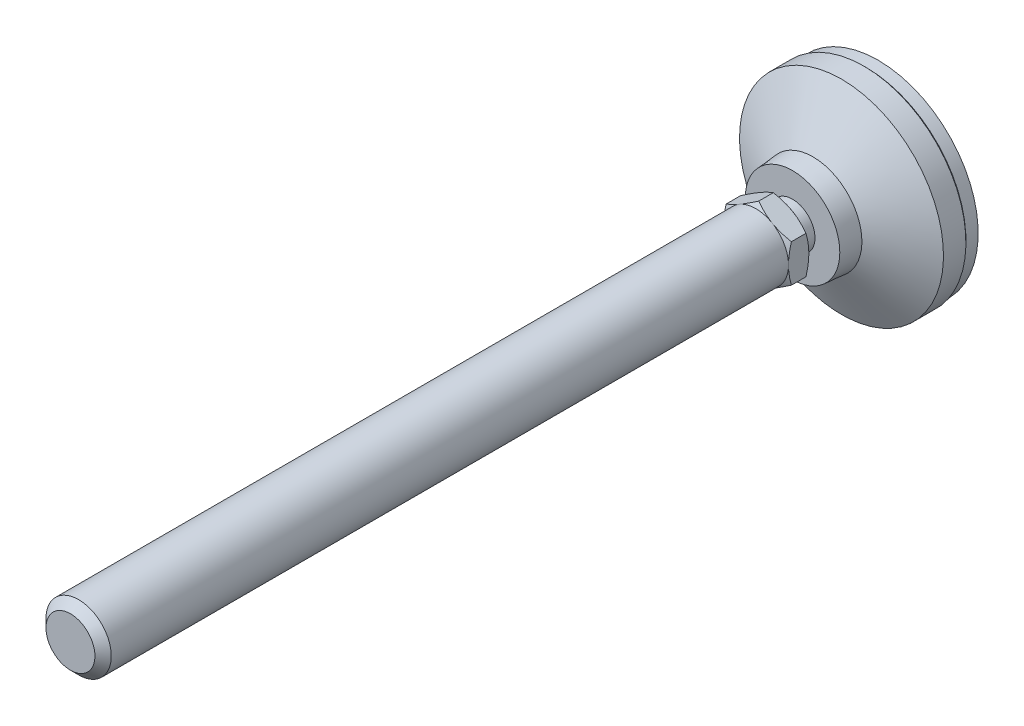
ISO-10303-21;
HEADER;
FILE_DESCRIPTION(('STEP AP214'),'2;1');
FILE_NAME('part.step','',(''),(''),'','','');
FILE_SCHEMA(('AUTOMOTIVE_DESIGN { 1 0 10303 214 1 1 1 1 }'));
ENDSEC;
DATA;
#1=APPLICATION_CONTEXT('core data for automotive mechanical design processes');
#2=APPLICATION_PROTOCOL_DEFINITION('international standard','automotive_design',2000,#1);
#3=PRODUCT_CONTEXT('',#1,'mechanical');
#4=PRODUCT('Part','Part','',(#3));
#5=PRODUCT_RELATED_PRODUCT_CATEGORY('part','',(#4));
#6=PRODUCT_DEFINITION_FORMATION('','',#4);
#7=PRODUCT_DEFINITION_CONTEXT('part definition',#1,'design');
#8=PRODUCT_DEFINITION('design','',#6,#7);
#9=PRODUCT_DEFINITION_SHAPE('','',#8);
#10=(LENGTH_UNIT() NAMED_UNIT(*) SI_UNIT(.MILLI.,.METRE.));
#11=(NAMED_UNIT(*) PLANE_ANGLE_UNIT() SI_UNIT($,.RADIAN.));
#12=(NAMED_UNIT(*) SI_UNIT($,.STERADIAN.) SOLID_ANGLE_UNIT());
#13=UNCERTAINTY_MEASURE_WITH_UNIT(LENGTH_MEASURE(1.E-05),#10,'distance_accuracy_value','');
#14=(GEOMETRIC_REPRESENTATION_CONTEXT(3) GLOBAL_UNCERTAINTY_ASSIGNED_CONTEXT((#13)) GLOBAL_UNIT_ASSIGNED_CONTEXT((#10,
#11,#12)) REPRESENTATION_CONTEXT('',''));
#15=CARTESIAN_POINT('',(0.,0.,0.));
#16=DIRECTION('',(0.,0.,1.));
#17=DIRECTION('',(1.,0.,0.));
#18=AXIS2_PLACEMENT_3D('',#15,#16,#17);
#19=CARTESIAN_POINT('',(0.,-5.50000000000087,24.9999999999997));
#20=DIRECTION('',(0.,0.,-1.));
#21=DIRECTION('',(0.,1.,0.));
#22=AXIS2_PLACEMENT_3D('',#19,#20,#21);
#23=PLANE('',#22);
#24=CARTESIAN_POINT('',(0.,0.,24.9999999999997));
#25=DIRECTION('',(0.,0.,-1.));
#26=DIRECTION('',(0.,1.,0.));
#27=AXIS2_PLACEMENT_3D('',#24,#25,#26);
#28=CIRCLE('',#27,8.00000000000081);
#29=CARTESIAN_POINT('',(-4.00000000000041,6.92820323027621,24.9999999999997));
#30=VERTEX_POINT('',#29);
#31=CARTESIAN_POINT('',(-8.00000000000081,0.,24.9999999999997));
#32=VERTEX_POINT('',#31);
#33=EDGE_CURVE('E9',#30,#32,#28,.F.);
#34=ORIENTED_EDGE('',*,*,#33,.F.);
#35=CARTESIAN_POINT('',(4.,6.92820323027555,24.9999999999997));
#36=VERTEX_POINT('',#35);
#37=EDGE_CURVE('E18',#36,#30,#28,.F.);
#38=ORIENTED_EDGE('',*,*,#37,.F.);
#39=CARTESIAN_POINT('',(8.00000000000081,0.,24.9999999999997));
#40=VERTEX_POINT('',#39);
#41=EDGE_CURVE('E125',#40,#36,#28,.F.);
#42=ORIENTED_EDGE('',*,*,#41,.F.);
#43=CARTESIAN_POINT('',(0.,0.,24.9999999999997));
#44=DIRECTION('',(0.,0.,1.));
#45=DIRECTION('',(0.,-1.,0.));
#46=AXIS2_PLACEMENT_3D('',#43,#44,#45);
#47=CIRCLE('',#46,8.00000000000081);
#48=CARTESIAN_POINT('',(4.00000000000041,-6.92820323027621,24.9999999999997));
#49=VERTEX_POINT('',#48);
#50=EDGE_CURVE('E608',#49,#40,#47,.T.);
#51=ORIENTED_EDGE('',*,*,#50,.F.);
#52=CARTESIAN_POINT('',(-4.00000000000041,-6.92820323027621,24.9999999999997));
#53=VERTEX_POINT('',#52);
#54=EDGE_CURVE('E610',#53,#49,#28,.F.);
#55=ORIENTED_EDGE('',*,*,#54,.F.);
#56=EDGE_CURVE('E23',#32,#53,#28,.F.);
#57=ORIENTED_EDGE('',*,*,#56,.F.);
#58=EDGE_LOOP('',(#34,#38,#42,#51,#55,#57));
#59=FACE_BOUND('',#58,.T.);
#60=CARTESIAN_POINT('',(0.,0.,24.9999999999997));
#61=DIRECTION('',(0.,0.,-1.));
#62=DIRECTION('',(0.,1.,0.));
#63=AXIS2_PLACEMENT_3D('',#60,#61,#62);
#64=CIRCLE('',#63,5.50000000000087);
#65=CARTESIAN_POINT('',(0.,5.50000000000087,24.9999999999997));
#66=VERTEX_POINT('',#65);
#67=EDGE_CURVE('E235',#66,#66,#64,.T.);
#68=ORIENTED_EDGE('',*,*,#67,.F.);
#69=EDGE_LOOP('',(#68));
#70=FACE_BOUND('',#69,.T.);
#71=ADVANCED_FACE('F14',(#59,#70),#23,.T.);
#72=CARTESIAN_POINT('',(0.,0.,2.));
#73=DIRECTION('',(0.,0.,-1.));
#74=DIRECTION('',(0.,1.,0.));
#75=AXIS2_PLACEMENT_3D('',#72,#73,#74);
#76=CYLINDRICAL_SURFACE('',#75,5.50000000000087);
#77=CARTESIAN_POINT('',(0.,0.,21.));
#78=DIRECTION('',(0.,0.,-1.));
#79=DIRECTION('',(0.,1.,0.));
#80=AXIS2_PLACEMENT_3D('',#77,#78,#79);
#81=CIRCLE('',#80,5.50000000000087);
#82=CARTESIAN_POINT('',(0.,5.50000000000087,21.));
#83=VERTEX_POINT('',#82);
#84=EDGE_CURVE('E238',#83,#83,#81,.T.);
#85=ORIENTED_EDGE('',*,*,#84,.F.);
#86=EDGE_LOOP('',(#85));
#87=FACE_BOUND('',#86,.T.);
#88=ORIENTED_EDGE('',*,*,#67,.T.);
#89=EDGE_LOOP('',(#88));
#90=FACE_BOUND('',#89,.T.);
#91=ADVANCED_FACE('F297',(#87,#90),#76,.T.);
#92=CARTESIAN_POINT('',(0.,-5.50000000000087,21.));
#93=DIRECTION('',(0.,0.,1.));
#94=DIRECTION('',(0.,-1.,0.));
#95=AXIS2_PLACEMENT_3D('',#92,#93,#94);
#96=PLANE('',#95);
#97=ORIENTED_EDGE('',*,*,#84,.T.);
#98=EDGE_LOOP('',(#97));
#99=FACE_BOUND('',#98,.T.);
#100=CARTESIAN_POINT('',(0.,0.,21.));
#101=DIRECTION('',(0.,0.,1.));
#102=DIRECTION('',(0.,-1.,0.));
#103=AXIS2_PLACEMENT_3D('',#100,#101,#102);
#104=CIRCLE('',#103,11.5833333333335);
#105=CARTESIAN_POINT('',(0.,-11.5833333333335,21.));
#106=VERTEX_POINT('',#105);
#107=EDGE_CURVE('E241',#106,#106,#104,.T.);
#108=ORIENTED_EDGE('',*,*,#107,.T.);
#109=EDGE_LOOP('',(#108));
#110=FACE_BOUND('',#109,.T.);
#111=ADVANCED_FACE('F199',(#99,#110),#96,.T.);
#112=CARTESIAN_POINT('',(0.,0.,2.));
#113=DIRECTION('',(0.,0.,-1.));
#114=DIRECTION('',(0.,1.,0.));
#115=AXIS2_PLACEMENT_3D('',#112,#113,#114);
#116=CYLINDRICAL_SURFACE('',#115,25.);
#117=CARTESIAN_POINT('',(0.,0.,3.5));
#118=DIRECTION('',(0.,0.,-1.));
#119=DIRECTION('',(0.,1.,0.));
#120=AXIS2_PLACEMENT_3D('',#117,#118,#119);
#121=CIRCLE('',#120,25.);
#122=CARTESIAN_POINT('',(0.,25.,3.5));
#123=VERTEX_POINT('',#122);
#124=EDGE_CURVE('E126',#123,#123,#121,.F.);
#125=ORIENTED_EDGE('',*,*,#124,.T.);
#126=EDGE_LOOP('',(#125));
#127=FACE_BOUND('',#126,.T.);
#128=CARTESIAN_POINT('',(0.,0.,8.9999999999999));
#129=DIRECTION('',(0.,0.,-1.));
#130=DIRECTION('',(0.,1.,0.));
#131=AXIS2_PLACEMENT_3D('',#128,#129,#130);
#132=CIRCLE('',#131,25.);
#133=CARTESIAN_POINT('',(0.,25.,8.9999999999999));
#134=VERTEX_POINT('',#133);
#135=EDGE_CURVE('E244',#134,#134,#132,.T.);
#136=ORIENTED_EDGE('',*,*,#135,.T.);
#137=EDGE_LOOP('',(#136));
#138=FACE_BOUND('',#137,.T.);
#139=ADVANCED_FACE('F275',(#127,#138),#116,.T.);
#140=CARTESIAN_POINT('',(0.,0.,16.));
#141=DIRECTION('',(0.,0.,-1.));
#142=DIRECTION('',(0.,1.,0.));
#143=AXIS2_PLACEMENT_3D('',#140,#141,#142);
#144=CONICAL_SURFACE('',#143,12.0000000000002,1.07685495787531);
#145=ORIENTED_EDGE('',*,*,#135,.F.);
#146=EDGE_LOOP('',(#145));
#147=FACE_BOUND('',#146,.T.);
#148=CARTESIAN_POINT('',(0.,0.,16.));
#149=DIRECTION('',(0.,0.,-1.));
#150=DIRECTION('',(0.,1.,0.));
#151=AXIS2_PLACEMENT_3D('',#148,#149,#150);
#152=CIRCLE('',#151,12.0000000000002);
#153=CARTESIAN_POINT('',(0.,12.0000000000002,16.));
#154=VERTEX_POINT('',#153);
#155=EDGE_CURVE('E260',#154,#154,#152,.T.);
#156=ORIENTED_EDGE('',*,*,#155,.T.);
#157=EDGE_LOOP('',(#156));
#158=FACE_BOUND('',#157,.T.);
#159=ADVANCED_FACE('F332',(#147,#158),#144,.T.);
#160=CARTESIAN_POINT('',(0.,0.,22.));
#161=DIRECTION('',(0.,0.,-1.));
#162=DIRECTION('',(0.,1.,0.));
#163=AXIS2_PLACEMENT_3D('',#160,#161,#162);
#164=CONICAL_SURFACE('',#163,11.5000000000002,0.0831412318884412);
#165=ORIENTED_EDGE('',*,*,#155,.F.);
#166=EDGE_LOOP('',(#165));
#167=FACE_BOUND('',#166,.T.);
#168=ORIENTED_EDGE('',*,*,#107,.F.);
#169=EDGE_LOOP('',(#168));
#170=FACE_BOUND('',#169,.T.);
#171=ADVANCED_FACE('F281',(#167,#170),#164,.T.);
#172=CARTESIAN_POINT('',(0.,0.,3.));
#173=DIRECTION('',(0.,0.,1.));
#174=DIRECTION('',(0.,-1.,0.));
#175=AXIS2_PLACEMENT_3D('',#172,#173,#174);
#176=CONICAL_SURFACE('',#175,24.5,0.785398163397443);
#177=ORIENTED_EDGE('',*,*,#124,.F.);
#178=EDGE_LOOP('',(#177));
#179=FACE_BOUND('',#178,.T.);
#180=CARTESIAN_POINT('',(0.,0.,3.));
#181=DIRECTION('',(0.,0.,-1.));
#182=DIRECTION('',(0.,1.,0.));
#183=AXIS2_PLACEMENT_3D('',#180,#181,#182);
#184=CIRCLE('',#183,24.5);
#185=CARTESIAN_POINT('',(0.,24.5,3.));
#186=VERTEX_POINT('',#185);
#187=EDGE_CURVE('E270',#186,#186,#184,.T.);
#188=ORIENTED_EDGE('',*,*,#187,.F.);
#189=EDGE_LOOP('',(#188));
#190=FACE_BOUND('',#189,.T.);
#191=ADVANCED_FACE('F16',(#179,#190),#176,.T.);
#192=CARTESIAN_POINT('',(0.,0.,0.));
#193=DIRECTION('',(0.,0.,1.));
#194=DIRECTION('',(0.,-1.,0.));
#195=AXIS2_PLACEMENT_3D('',#192,#193,#194);
#196=CYLINDRICAL_SURFACE('',#195,24.5);
#197=CARTESIAN_POINT('',(0.,0.,0.));
#198=DIRECTION('',(0.,0.,-1.));
#199=DIRECTION('',(0.,1.,0.));
#200=AXIS2_PLACEMENT_3D('',#197,#198,#199);
#201=CIRCLE('',#200,24.5);
#202=CARTESIAN_POINT('',(0.,24.5,0.));
#203=VERTEX_POINT('',#202);
#204=EDGE_CURVE('E226',#203,#203,#201,.T.);
#205=ORIENTED_EDGE('',*,*,#204,.F.);
#206=EDGE_LOOP('',(#205));
#207=FACE_BOUND('',#206,.T.);
#208=ORIENTED_EDGE('',*,*,#187,.T.);
#209=EDGE_LOOP('',(#208));
#210=FACE_BOUND('',#209,.T.);
#211=ADVANCED_FACE('F280',(#207,#210),#196,.T.);
#212=CARTESIAN_POINT('',(0.,0.,0.));
#213=DIRECTION('',(0.,0.,-1.));
#214=DIRECTION('',(0.,1.,0.));
#215=AXIS2_PLACEMENT_3D('',#212,#213,#214);
#216=PLANE('',#215);
#217=ORIENTED_EDGE('',*,*,#204,.T.);
#218=EDGE_LOOP('',(#217));
#219=FACE_BOUND('',#218,.T.);
#220=ADVANCED_FACE('F285',(#219),#216,.T.);
#221=CARTESIAN_POINT('',(0.,0.,24.9999999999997));
#222=DIRECTION('',(0.,0.,1.));
#223=DIRECTION('',(0.,-1.,0.));
#224=AXIS2_PLACEMENT_3D('',#221,#222,#223);
#225=CONICAL_SURFACE('',#224,8.00000000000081,1.0471975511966);
#226=CARTESIAN_POINT('',(-8.0002,4.61868668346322,25.7145978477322));
#227=CARTESIAN_POINT('',(-7.8243512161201,4.72021302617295,25.6559907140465));
#228=CARTESIAN_POINT('',(-7.64784680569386,4.8221178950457,25.6000434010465));
#229=CARTESIAN_POINT('',(-7.29340453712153,5.02675523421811,25.4942010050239));
#230=CARTESIAN_POINT('',(-7.11546609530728,5.12948804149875,25.4443085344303));
#231=CARTESIAN_POINT('',(-6.57880176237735,5.43933133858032,25.3046927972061));
#232=CARTESIAN_POINT('',(-6.21795741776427,5.64766491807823,25.2252811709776));
#233=CARTESIAN_POINT('',(-5.67796082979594,5.95943209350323,25.1321616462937));
#234=CARTESIAN_POINT('',(-5.50042181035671,6.06193429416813,25.1056345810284));
#235=CARTESIAN_POINT('',(-5.1445408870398,6.2674022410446,25.0611531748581));
#236=CARTESIAN_POINT('',(-4.96619905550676,6.37036794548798,25.0431980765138));
#237=CARTESIAN_POINT('',(-4.6092083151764,6.57647664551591,25.0163156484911));
#238=CARTESIAN_POINT('',(-4.43055998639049,6.67961930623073,25.0073780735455));
#239=CARTESIAN_POINT('',(-4.07309829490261,6.88599991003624,24.9987223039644));
#240=CARTESIAN_POINT('',(-3.89428493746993,6.9892378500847,24.9990038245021));
#241=CARTESIAN_POINT('',(-3.55998663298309,7.18224506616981,25.0081450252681));
#242=CARTESIAN_POINT('',(-3.40447809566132,7.27202796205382,25.0158896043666));
#243=CARTESIAN_POINT('',(-3.09382523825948,7.4513834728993,25.0382011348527));
#244=CARTESIAN_POINT('',(-2.93868094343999,7.54095607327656,25.0527685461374));
#245=CARTESIAN_POINT('',(-2.47384868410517,7.80932710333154,25.1063606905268));
#246=CARTESIAN_POINT('',(-2.16498351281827,7.98765049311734,25.1552686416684));
#247=CARTESIAN_POINT('',(-1.54397677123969,8.3461889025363,25.2775394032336));
#248=CARTESIAN_POINT('',(-1.23191445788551,8.52635816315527,25.3514205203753));
#249=CARTESIAN_POINT('',(-0.61244351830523,8.8840098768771,25.5191001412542));
#250=CARTESIAN_POINT('',(-0.305026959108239,9.06149691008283,25.6128592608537));
#251=CARTESIAN_POINT('',(0.000200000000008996,9.23771977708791,25.7145978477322));
#252=B_SPLINE_CURVE_WITH_KNOTS('',3,(#226,#227,#228,#229,#230,#231,#232,#233,#234,#235,#236,
#237,#238,#239,#240,#241,#242,#243,#244,#245,#246,#247,#248,#249,#250,#251),.UNSPECIFIED.,.F.,
.F.,(4,2,2,2,2,2,2,2,2,2,2,2,4),(0.,0.633973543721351,1.26821965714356,2.53934712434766,
3.15934343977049,3.77928496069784,4.39852133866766,5.01773858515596,5.55680239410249,
6.09590254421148,7.17487077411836,8.27776850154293,9.37850115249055),.UNSPECIFIED.);
#253=CARTESIAN_POINT('',(0.,9.23760430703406,25.7145311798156));
#254=VERTEX_POINT('',#253);
#255=EDGE_CURVE('E115',#30,#254,#252,.T.);
#256=ORIENTED_EDGE('',*,*,#255,.T.);
#257=CARTESIAN_POINT('',(-0.000199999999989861,9.2377197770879,25.7145978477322));
#258=CARTESIAN_POINT('',(0.175648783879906,9.13619343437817,25.6559907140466));
#259=CARTESIAN_POINT('',(0.352153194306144,9.03428856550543,25.6000434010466));
#260=CARTESIAN_POINT('',(0.706595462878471,8.82965122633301,25.4942010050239));
#261=CARTESIAN_POINT('',(0.884533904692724,8.72691841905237,25.4443085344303));
#262=CARTESIAN_POINT('',(1.42119823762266,8.4170751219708,25.3046927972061));
#263=CARTESIAN_POINT('',(1.78204258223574,8.20874154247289,25.2252811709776));
#264=CARTESIAN_POINT('',(2.32203917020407,7.89697436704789,25.1321616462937));
#265=CARTESIAN_POINT('',(2.4995781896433,7.79447216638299,25.1056345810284));
#266=CARTESIAN_POINT('',(2.85545911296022,7.58900421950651,25.0611531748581));
#267=CARTESIAN_POINT('',(3.03380094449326,7.48603851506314,25.0431980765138));
#268=CARTESIAN_POINT('',(3.39079168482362,7.27992981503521,25.0163156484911));
#269=CARTESIAN_POINT('',(3.56944001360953,7.17678715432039,25.0073780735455));
#270=CARTESIAN_POINT('',(3.92690170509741,6.97040655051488,24.9987223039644));
#271=CARTESIAN_POINT('',(4.1057150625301,6.86716861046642,24.9990038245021));
#272=CARTESIAN_POINT('',(4.44001336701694,6.67416139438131,25.0081450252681));
#273=CARTESIAN_POINT('',(4.5955219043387,6.5843784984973,25.0158896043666));
#274=CARTESIAN_POINT('',(4.90617476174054,6.40502298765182,25.0382011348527));
#275=CARTESIAN_POINT('',(5.06131905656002,6.31545038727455,25.0527685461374));
#276=CARTESIAN_POINT('',(5.52615131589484,6.04707935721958,25.1063606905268));
#277=CARTESIAN_POINT('',(5.83501648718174,5.86875596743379,25.1552686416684));
#278=CARTESIAN_POINT('',(6.45602322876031,5.51021755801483,25.2775394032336));
#279=CARTESIAN_POINT('',(6.76808554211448,5.33004829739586,25.3514205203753));
#280=CARTESIAN_POINT('',(7.38755648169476,4.97239658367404,25.5191001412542));
#281=CARTESIAN_POINT('',(7.69497304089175,4.79490955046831,25.6128592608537));
#282=CARTESIAN_POINT('',(8.0002,4.61868668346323,25.7145978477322));
#283=B_SPLINE_CURVE_WITH_KNOTS('',3,(#257,#258,#259,#260,#261,#262,#263,#264,#265,#266,#267,
#268,#269,#270,#271,#272,#273,#274,#275,#276,#277,#278,#279,#280,#281,#282),.UNSPECIFIED.,.F.,
.F.,(4,2,2,2,2,2,2,2,2,2,2,2,4),(0.,0.633973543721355,1.26821965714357,2.53934712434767,
3.1593434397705,3.77928496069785,4.39852133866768,5.01773858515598,5.55680239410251,
6.09590254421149,7.17487077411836,8.27776850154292,9.37850115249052),.UNSPECIFIED.);
#284=EDGE_CURVE('E121',#254,#36,#283,.T.);
#285=ORIENTED_EDGE('',*,*,#284,.T.);
#286=ORIENTED_EDGE('',*,*,#37,.T.);
#287=EDGE_LOOP('',(#256,#285,#286));
#288=FACE_BOUND('',#287,.T.);
#289=ADVANCED_FACE('F119',(#288),#225,.T.);
#290=CARTESIAN_POINT('',(8.,12.3262731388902,28.865241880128));
#291=CARTESIAN_POINT('',(8.,11.9775305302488,28.6963953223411));
#292=CARTESIAN_POINT('',(8.,11.6279786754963,28.5291911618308));
#293=CARTESIAN_POINT('',(8.,10.9268257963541,28.1989930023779));
#294=CARTESIAN_POINT('',(8.,10.5752244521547,28.0359996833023));
#295=CARTESIAN_POINT('',(8.,9.86769141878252,27.7143112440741));
#296=CARTESIAN_POINT('',(8.,9.511746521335,27.5556450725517));
#297=CARTESIAN_POINT('',(8.,8.79699745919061,27.2449141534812));
#298=CARTESIAN_POINT('',(8.,8.43819343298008,27.092849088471));
#299=CARTESIAN_POINT('',(8.,7.70588014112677,26.7924406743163));
#300=CARTESIAN_POINT('',(8.,7.33226167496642,26.6443620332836));
#301=CARTESIAN_POINT('',(8.,6.58062493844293,26.3596078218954));
#302=CARTESIAN_POINT('',(8.,6.20260617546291,26.2229335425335));
#303=CARTESIAN_POINT('',(8.,5.44229684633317,25.9646356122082));
#304=CARTESIAN_POINT('',(8.,5.06001698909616,25.8429807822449));
#305=CARTESIAN_POINT('',(8.,4.28998858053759,25.6186766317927));
#306=CARTESIAN_POINT('',(8.,3.90224181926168,25.5160212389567));
#307=CARTESIAN_POINT('',(8.,3.12313529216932,25.3352448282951));
#308=CARTESIAN_POINT('',(8.,2.73180659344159,25.2569935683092));
#309=CARTESIAN_POINT('',(8.,2.14131517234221,25.1613463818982));
#310=CARTESIAN_POINT('',(8.,1.94388648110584,25.1330842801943));
#311=CARTESIAN_POINT('',(8.,1.54807537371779,25.0843594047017));
#312=CARTESIAN_POINT('',(8.,1.34969305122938,25.0638958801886));
#313=CARTESIAN_POINT('',(8.,0.954796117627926,25.0314283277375));
#314=CARTESIAN_POINT('',(8.,0.758290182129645,25.0193191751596));
#315=CARTESIAN_POINT('',(8.,0.364942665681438,25.0034158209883));
#316=CARTESIAN_POINT('',(8.,0.168101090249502,24.9996214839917));
#317=CARTESIAN_POINT('',(8.,-0.225566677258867,25.0004380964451));
#318=CARTESIAN_POINT('',(8.,-0.422392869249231,25.0050490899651));
#319=CARTESIAN_POINT('',(8.,-0.815678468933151,25.0225650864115));
#320=CARTESIAN_POINT('',(8.,-1.01213785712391,25.0354705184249));
#321=CARTESIAN_POINT('',(8.,-1.48676568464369,25.0763980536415));
#322=CARTESIAN_POINT('',(8.,-1.7645900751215,25.1084929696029));
#323=CARTESIAN_POINT('',(8.,-2.31811044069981,25.1875002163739));
#324=CARTESIAN_POINT('',(8.,-2.59380611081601,25.2344146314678));
#325=CARTESIAN_POINT('',(8.,-3.41742295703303,25.3948936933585));
#326=CARTESIAN_POINT('',(8.,-3.96155187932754,25.528162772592));
#327=CARTESIAN_POINT('',(8.,-4.7750432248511,25.7584190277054));
#328=CARTESIAN_POINT('',(8.,-5.04864650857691,25.8412779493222));
#329=CARTESIAN_POINT('',(8.,-5.59319443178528,26.0153922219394));
#330=CARTESIAN_POINT('',(8.,-5.86413905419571,26.1066476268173));
#331=CARTESIAN_POINT('',(8.,-6.40345876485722,26.2961082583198));
#332=CARTESIAN_POINT('',(8.,-6.67183471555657,26.394311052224));
#333=CARTESIAN_POINT('',(8.,-7.20637750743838,26.5965320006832));
#334=CARTESIAN_POINT('',(8.,-7.4725443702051,26.7005500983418));
#335=CARTESIAN_POINT('',(8.,-8.08232914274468,26.9453078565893));
#336=CARTESIAN_POINT('',(8.,-8.42527540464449,27.0877173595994));
#337=CARTESIAN_POINT('',(8.,-9.10839625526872,27.379052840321));
#338=CARTESIAN_POINT('',(8.,-9.44857070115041,27.5279791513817));
#339=CARTESIAN_POINT('',(8.,-10.1266404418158,27.8310930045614));
#340=CARTESIAN_POINT('',(8.,-10.4645352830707,27.9852815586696));
#341=CARTESIAN_POINT('',(8.,-11.1383455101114,28.2979008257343));
#342=CARTESIAN_POINT('',(8.,-11.4742609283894,28.4563314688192));
#343=CARTESIAN_POINT('',(8.,-12.1447339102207,28.7768152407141));
#344=CARTESIAN_POINT('',(8.,-12.4792899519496,28.938871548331));
#345=CARTESIAN_POINT('',(8.,-13.146990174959,29.2658694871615));
#346=CARTESIAN_POINT('',(8.,-13.4801343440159,29.4308111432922));
#347=CARTESIAN_POINT('',(8.,-14.477789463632,29.9292294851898));
#348=CARTESIAN_POINT('',(8.,-15.1405093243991,30.266292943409));
#349=CARTESIAN_POINT('',(8.,-16.1057093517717,30.7634786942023));
#350=CARTESIAN_POINT('',(8.,-16.4095795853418,30.9209192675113));
#351=CARTESIAN_POINT('',(8.,-17.0166569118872,31.2370623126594));
#352=CARTESIAN_POINT('',(8.,-17.319864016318,31.3957647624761));
#353=CARTESIAN_POINT('',(8.,-18.2286454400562,31.8735243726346));
#354=CARTESIAN_POINT('',(8.,-18.8333572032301,32.194222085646));
#355=CARTESIAN_POINT('',(8.,-20.0396119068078,32.8382356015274));
#356=CARTESIAN_POINT('',(8.,-20.6411589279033,33.1615437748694));
#357=CARTESIAN_POINT('',(8.,-21.8427836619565,33.8108079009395));
#358=CARTESIAN_POINT('',(8.,-22.4428614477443,34.1367637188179));
#359=CARTESIAN_POINT('',(8.,-23.0423928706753,34.4637150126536));
#360=B_SPLINE_CURVE_WITH_KNOTS('',3,(#290,#291,#292,#293,#294,#295,#296,#297,#298,#299,#300,
#301,#302,#303,#304,#305,#306,#307,#308,#309,#310,#311,#312,#313,#314,#315,#316,#317,#318,#319,
#320,#321,#322,#323,#324,#325,#326,#327,#328,#329,#330,#331,#332,#333,#334,#335,#336,#337,#338,
#339,#340,#341,#342,#343,#344,#345,#346,#347,#348,#349,#350,#351,#352,#353,#354,#355,#356,#357,
#358,#359),.UNSPECIFIED.,.F.,.F.,(4,2,2,2,2,2,2,2,2,2,2,2,2,2,2,2,2,2,2,2,2,2,2,2,2,2,2,2,2,2,2,
2,2,2,4),(0.,1.16241516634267,2.32501685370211,3.49408487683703,4.66309661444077,
5.86863143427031,7.0743025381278,8.27742712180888,9.4801665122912,10.6763725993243,
11.2745666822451,11.8727031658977,12.4631687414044,13.0536247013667,13.6440837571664,
14.2345733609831,15.0731140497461,15.9117727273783,17.5900565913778,18.4476120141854,
19.3051729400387,20.1624350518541,21.0196887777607,22.1336168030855,23.2476018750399,
24.3618023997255,25.4759845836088,26.5911851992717,27.7063954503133,29.9368615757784,
30.9635649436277,31.9902504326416,34.0436979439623,36.0924670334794,38.1411324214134),.UNSPECIFIED.);
#361=CARTESIAN_POINT('',(8.,4.61880215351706,25.7145311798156));
#362=VERTEX_POINT('',#361);
#363=EDGE_CURVE('E134',#362,#40,#360,.T.);
#364=ORIENTED_EDGE('',*,*,#363,.T.);
#365=ORIENTED_EDGE('',*,*,#41,.T.);
#366=EDGE_CURVE('E171',#36,#362,#283,.T.);
#367=ORIENTED_EDGE('',*,*,#366,.T.);
#368=EDGE_LOOP('',(#364,#365,#367));
#369=FACE_BOUND('',#368,.T.);
#370=ADVANCED_FACE('F159',(#369),#225,.T.);
#371=CARTESIAN_POINT('',(8.0002,-4.61868668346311,25.7145978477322));
#372=CARTESIAN_POINT('',(7.82435121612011,-4.72021302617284,25.6559907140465));
#373=CARTESIAN_POINT('',(7.64784680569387,-4.82211789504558,25.6000434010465));
#374=CARTESIAN_POINT('',(7.29340453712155,-5.02675523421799,25.4942010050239));
#375=CARTESIAN_POINT('',(7.1154660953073,-5.12948804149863,25.4443085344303));
#376=CARTESIAN_POINT('',(6.57880176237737,-5.4393313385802,25.3046927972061));
#377=CARTESIAN_POINT('',(6.21795741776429,-5.64766491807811,25.2252811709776));
#378=CARTESIAN_POINT('',(5.67796082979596,-5.95943209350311,25.1321616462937));
#379=CARTESIAN_POINT('',(5.50042181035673,-6.06193429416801,25.1056345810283));
#380=CARTESIAN_POINT('',(5.14454088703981,-6.26740224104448,25.0611531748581));
#381=CARTESIAN_POINT('',(4.96619905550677,-6.37036794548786,25.0431980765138));
#382=CARTESIAN_POINT('',(4.60920831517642,-6.57647664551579,25.0163156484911));
#383=CARTESIAN_POINT('',(4.43055998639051,-6.67961930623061,25.0073780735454));
#384=CARTESIAN_POINT('',(4.07309829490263,-6.88599991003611,24.9987223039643));
#385=CARTESIAN_POINT('',(3.89428493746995,-6.98923785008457,24.999003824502));
#386=CARTESIAN_POINT('',(3.55998663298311,-7.18224506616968,25.008145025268));
#387=CARTESIAN_POINT('',(3.40447809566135,-7.27202796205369,25.0158896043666));
#388=CARTESIAN_POINT('',(3.09382523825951,-7.45138347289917,25.0382011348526));
#389=CARTESIAN_POINT('',(2.93868094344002,-7.54095607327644,25.0527685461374));
#390=CARTESIAN_POINT('',(2.4738486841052,-7.80932710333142,25.1063606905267));
#391=CARTESIAN_POINT('',(2.16498351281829,-7.98765049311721,25.1552686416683));
#392=CARTESIAN_POINT('',(1.54397677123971,-8.34618890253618,25.2775394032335));
#393=CARTESIAN_POINT('',(1.23191445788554,-8.52635816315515,25.3514205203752));
#394=CARTESIAN_POINT('',(0.61244351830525,-8.88400987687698,25.5191001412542));
#395=CARTESIAN_POINT('',(0.305026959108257,-9.06149691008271,25.6128592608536));
#396=CARTESIAN_POINT('',(-0.000199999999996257,-9.23771977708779,25.7145978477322));
#397=B_SPLINE_CURVE_WITH_KNOTS('',3,(#371,#372,#373,#374,#375,#376,#377,#378,#379,#380,#381,
#382,#383,#384,#385,#386,#387,#388,#389,#390,#391,#392,#393,#394,#395,#396),.UNSPECIFIED.,.F.,
.F.,(4,2,2,2,2,2,2,2,2,2,2,2,4),(0.,0.633973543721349,1.26821965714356,2.53934712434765,
3.15934343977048,3.77928496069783,4.39852133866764,5.01773858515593,5.55680239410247,
6.09590254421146,7.17487077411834,8.27776850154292,9.37850115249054),.UNSPECIFIED.);
#398=CARTESIAN_POINT('',(8.,-4.61880215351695,25.7145311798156));
#399=VERTEX_POINT('',#398);
#400=EDGE_CURVE('E149',#399,#49,#397,.T.);
#401=ORIENTED_EDGE('',*,*,#400,.T.);
#402=ORIENTED_EDGE('',*,*,#50,.T.);
#403=EDGE_CURVE('E114',#40,#399,#360,.T.);
#404=ORIENTED_EDGE('',*,*,#403,.T.);
#405=EDGE_LOOP('',(#401,#402,#404));
#406=FACE_BOUND('',#405,.T.);
#407=ADVANCED_FACE('F163',(#406),#225,.T.);
#408=CARTESIAN_POINT('',(0.00020000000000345,-9.23771977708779,25.7145978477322));
#409=CARTESIAN_POINT('',(-0.175648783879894,-9.13619343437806,25.6559907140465));
#410=CARTESIAN_POINT('',(-0.352153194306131,-9.03428856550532,25.6000434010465));
#411=CARTESIAN_POINT('',(-0.706595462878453,-8.8296512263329,25.4942010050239));
#412=CARTESIAN_POINT('',(-0.884533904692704,-8.72691841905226,25.4443085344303));
#413=CARTESIAN_POINT('',(-1.42119823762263,-8.4170751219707,25.3046927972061));
#414=CARTESIAN_POINT('',(-1.78204258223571,-8.20874154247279,25.2252811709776));
#415=CARTESIAN_POINT('',(-2.32203917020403,-7.8969743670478,25.1321616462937));
#416=CARTESIAN_POINT('',(-2.49957818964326,-7.79447216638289,25.1056345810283));
#417=CARTESIAN_POINT('',(-2.85545911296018,-7.58900421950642,25.0611531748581));
#418=CARTESIAN_POINT('',(-3.03380094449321,-7.48603851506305,25.0431980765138));
#419=CARTESIAN_POINT('',(-3.39079168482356,-7.27992981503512,25.0163156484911));
#420=CARTESIAN_POINT('',(-3.56944001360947,-7.1767871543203,25.0073780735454));
#421=CARTESIAN_POINT('',(-3.92690170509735,-6.97040655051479,24.9987223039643));
#422=CARTESIAN_POINT('',(-4.10571506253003,-6.86716861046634,24.999003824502));
#423=CARTESIAN_POINT('',(-4.44001336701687,-6.67416139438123,25.008145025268));
#424=CARTESIAN_POINT('',(-4.59552190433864,-6.58437849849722,25.0158896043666));
#425=CARTESIAN_POINT('',(-4.90617476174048,-6.40502298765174,25.0382011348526));
#426=CARTESIAN_POINT('',(-5.06131905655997,-6.31545038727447,25.0527685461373));
#427=CARTESIAN_POINT('',(-5.52615131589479,-6.04707935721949,25.1063606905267));
#428=CARTESIAN_POINT('',(-5.8350164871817,-5.86875596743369,25.1552686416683));
#429=CARTESIAN_POINT('',(-6.45602322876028,-5.51021755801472,25.2775394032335));
#430=CARTESIAN_POINT('',(-6.76808554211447,-5.33004829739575,25.3514205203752));
#431=CARTESIAN_POINT('',(-7.38755648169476,-4.97239658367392,25.5191001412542));
#432=CARTESIAN_POINT('',(-7.69497304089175,-4.79490955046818,25.6128592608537));
#433=CARTESIAN_POINT('',(-8.0002,-4.6186866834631,25.7145978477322));
#434=B_SPLINE_CURVE_WITH_KNOTS('',3,(#408,#409,#410,#411,#412,#413,#414,#415,#416,#417,#418,
#419,#420,#421,#422,#423,#424,#425,#426,#427,#428,#429,#430,#431,#432,#433),.UNSPECIFIED.,.F.,
.F.,(4,2,2,2,2,2,2,2,2,2,2,2,4),(0.,0.633973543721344,1.26821965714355,2.53934712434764,
3.15934343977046,3.7792849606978,4.39852133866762,5.01773858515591,5.55680239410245,
6.09590254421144,7.17487077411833,8.27776850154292,9.37850115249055),.UNSPECIFIED.);
#435=CARTESIAN_POINT('',(0.,-9.23760430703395,25.7145311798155));
#436=VERTEX_POINT('',#435);
#437=EDGE_CURVE('E37',#436,#53,#434,.T.);
#438=ORIENTED_EDGE('',*,*,#437,.T.);
#439=ORIENTED_EDGE('',*,*,#54,.T.);
#440=EDGE_CURVE('E552',#49,#436,#397,.T.);
#441=ORIENTED_EDGE('',*,*,#440,.T.);
#442=EDGE_LOOP('',(#438,#439,#441));
#443=FACE_BOUND('',#442,.T.);
#444=ADVANCED_FACE('F165',(#443),#225,.T.);
#445=CARTESIAN_POINT('',(-8.,-4.61880215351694,25.7145311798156));
#446=VERTEX_POINT('',#445);
#447=EDGE_CURVE('E186',#53,#446,#434,.T.);
#448=ORIENTED_EDGE('',*,*,#447,.T.);
#449=CARTESIAN_POINT('',(-8.,12.3262731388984,28.8652418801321));
#450=CARTESIAN_POINT('',(-8.,11.9775305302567,28.6963953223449));
#451=CARTESIAN_POINT('',(-8.00000000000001,11.627978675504,28.5291911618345));
#452=CARTESIAN_POINT('',(-8.00000000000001,10.9268257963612,28.1989930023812));
#453=CARTESIAN_POINT('',(-8.00000000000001,10.5752244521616,28.0359996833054));
#454=CARTESIAN_POINT('',(-8.00000000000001,9.86769141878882,27.7143112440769));
#455=CARTESIAN_POINT('',(-8.00000000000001,9.51174652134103,27.5556450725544));
#456=CARTESIAN_POINT('',(-8.00000000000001,8.79699745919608,27.2449141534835));
#457=CARTESIAN_POINT('',(-8.00000000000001,8.43819343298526,27.0928490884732));
#458=CARTESIAN_POINT('',(-8.00000000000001,7.70588014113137,26.7924406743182));
#459=CARTESIAN_POINT('',(-8.00000000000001,7.33226167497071,26.6443620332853));
#460=CARTESIAN_POINT('',(-8.00000000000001,6.5806249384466,26.3596078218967));
#461=CARTESIAN_POINT('',(-8.,6.20260617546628,26.2229335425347));
#462=CARTESIAN_POINT('',(-8.,5.44229684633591,25.9646356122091));
#463=CARTESIAN_POINT('',(-8.00000000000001,5.06001698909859,25.8429807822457));
#464=CARTESIAN_POINT('',(-8.,4.28998858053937,25.6186766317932));
#465=CARTESIAN_POINT('',(-8.,3.90224181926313,25.5160212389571));
#466=CARTESIAN_POINT('',(-8.,3.12313529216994,25.3352448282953));
#467=CARTESIAN_POINT('',(-8.,2.73180659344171,25.2569935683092));
#468=CARTESIAN_POINT('',(-8.,2.14131517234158,25.1613463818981));
#469=CARTESIAN_POINT('',(-8.,1.94388648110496,25.1330842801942));
#470=CARTESIAN_POINT('',(-8.,1.54807537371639,25.0843594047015));
#471=CARTESIAN_POINT('',(-8.,1.34969305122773,25.0638958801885));
#472=CARTESIAN_POINT('',(-8.,0.954796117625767,25.0314283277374));
#473=CARTESIAN_POINT('',(-8.,0.758290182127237,25.0193191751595));
#474=CARTESIAN_POINT('',(-8.,0.36494266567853,25.0034158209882));
#475=CARTESIAN_POINT('',(-8.,0.168101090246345,24.9996214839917));
#476=CARTESIAN_POINT('',(-8.,-0.22556667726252,25.0004380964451));
#477=CARTESIAN_POINT('',(-8.,-0.422392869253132,25.0050490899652));
#478=CARTESIAN_POINT('',(-8.,-0.815678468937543,25.0225650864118));
#479=CARTESIAN_POINT('',(-8.,-1.01213785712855,25.0354705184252));
#480=CARTESIAN_POINT('',(-8.,-1.48676568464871,25.0763980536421));
#481=CARTESIAN_POINT('',(-8.,-1.76459007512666,25.1084929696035));
#482=CARTESIAN_POINT('',(-8.,-2.31811044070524,25.1875002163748));
#483=CARTESIAN_POINT('',(-8.,-2.59380611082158,25.2344146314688));
#484=CARTESIAN_POINT('',(-8.,-3.41742295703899,25.3948936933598));
#485=CARTESIAN_POINT('',(-8.,-3.96155187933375,25.5281627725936));
#486=CARTESIAN_POINT('',(-8.,-4.7750432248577,25.7584190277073));
#487=CARTESIAN_POINT('',(-8.,-5.04864650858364,25.8412779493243));
#488=CARTESIAN_POINT('',(-8.,-5.59319443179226,26.0153922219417));
#489=CARTESIAN_POINT('',(-8.,-5.86413905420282,26.1066476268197));
#490=CARTESIAN_POINT('',(-8.,-6.40345876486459,26.2961082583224));
#491=CARTESIAN_POINT('',(-8.,-6.67183471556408,26.3943110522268));
#492=CARTESIAN_POINT('',(-8.,-7.20637750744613,26.5965320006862));
#493=CARTESIAN_POINT('',(-8.,-7.47254437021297,26.7005500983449));
#494=CARTESIAN_POINT('',(-8.,-8.08232914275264,26.9453078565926));
#495=CARTESIAN_POINT('',(-8.,-8.42527540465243,27.0877173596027));
#496=CARTESIAN_POINT('',(-8.,-9.1083962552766,27.3790528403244));
#497=CARTESIAN_POINT('',(-8.,-9.44857070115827,27.5279791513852));
#498=CARTESIAN_POINT('',(-8.,-10.1266404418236,27.831093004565));
#499=CARTESIAN_POINT('',(-8.,-10.4645352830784,27.9852815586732));
#500=CARTESIAN_POINT('',(-8.,-11.1383455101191,28.297900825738));
#501=CARTESIAN_POINT('',(-8.,-11.4742609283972,28.4563314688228));
#502=CARTESIAN_POINT('',(-8.,-12.1447339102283,28.7768152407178));
#503=CARTESIAN_POINT('',(-8.,-12.4792899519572,28.9388715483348));
#504=CARTESIAN_POINT('',(-8.,-13.1469901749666,29.2658694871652));
#505=CARTESIAN_POINT('',(-8.,-13.4801343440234,29.430811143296));
#506=CARTESIAN_POINT('',(-8.,-14.4777894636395,29.9292294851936));
#507=CARTESIAN_POINT('',(-8.,-15.1405093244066,30.2662929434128));
#508=CARTESIAN_POINT('',(-8.,-16.1057093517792,30.7634786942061));
#509=CARTESIAN_POINT('',(-7.99999999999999,-16.4095795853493,30.9209192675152));
#510=CARTESIAN_POINT('',(-7.99999999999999,-17.0166569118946,31.2370623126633));
#511=CARTESIAN_POINT('',(-7.99999999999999,-17.3198640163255,31.39576476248));
#512=CARTESIAN_POINT('',(-7.99999999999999,-18.2286454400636,31.8735243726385));
#513=CARTESIAN_POINT('',(-7.99999999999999,-18.8333572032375,32.19422208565));
#514=CARTESIAN_POINT('',(-7.99999999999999,-20.0396119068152,32.8382356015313));
#515=CARTESIAN_POINT('',(-7.99999999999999,-20.6411589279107,33.1615437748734));
#516=CARTESIAN_POINT('',(-7.99999999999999,-21.8427836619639,33.8108079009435));
#517=CARTESIAN_POINT('',(-7.99999999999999,-22.4428614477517,34.1367637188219));
#518=CARTESIAN_POINT('',(-8.,-23.0423928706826,34.4637150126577));
#519=B_SPLINE_CURVE_WITH_KNOTS('',3,(#449,#450,#451,#452,#453,#454,#455,#456,#457,#458,#459,
#460,#461,#462,#463,#464,#465,#466,#467,#468,#469,#470,#471,#472,#473,#474,#475,#476,#477,#478,
#479,#480,#481,#482,#483,#484,#485,#486,#487,#488,#489,#490,#491,#492,#493,#494,#495,#496,#497,
#498,#499,#500,#501,#502,#503,#504,#505,#506,#507,#508,#509,#510,#511,#512,#513,#514,#515,#516,
#517,#518),.UNSPECIFIED.,.F.,.F.,(4,2,2,2,2,2,2,2,2,2,2,2,2,2,2,2,2,2,2,2,2,2,2,2,2,2,2,2,2,2,2,
2,2,2,4),(0.,1.16241516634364,2.32501685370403,3.49408487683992,4.66309661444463,
5.86863143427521,7.07430253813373,8.27742712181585,9.48016651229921,10.6763725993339,
11.2745666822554,11.8727031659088,12.4631687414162,13.0536247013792,13.6440837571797,
14.2345733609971,15.0731140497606,15.9117727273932,17.5900565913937,18.4476120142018,
19.3051729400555,20.1624350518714,21.0196887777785,22.1336168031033,23.2476018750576,
24.3618023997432,25.4759845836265,26.5911851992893,27.7063954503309,29.9368615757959,
30.9635649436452,31.9902504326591,34.0436979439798,36.0924670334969,38.1411324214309),.UNSPECIFIED.);
#520=EDGE_CURVE('E30',#446,#32,#519,.F.);
#521=ORIENTED_EDGE('',*,*,#520,.T.);
#522=ORIENTED_EDGE('',*,*,#56,.T.);
#523=EDGE_LOOP('',(#448,#521,#522));
#524=FACE_BOUND('',#523,.T.);
#525=ADVANCED_FACE('F447',(#524),#225,.T.);
#526=CARTESIAN_POINT('',(-8.,4.61880215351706,25.7145311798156));
#527=VERTEX_POINT('',#526);
#528=EDGE_CURVE('E109',#32,#527,#519,.F.);
#529=ORIENTED_EDGE('',*,*,#528,.T.);
#530=EDGE_CURVE('E103',#527,#30,#252,.T.);
#531=ORIENTED_EDGE('',*,*,#530,.T.);
#532=ORIENTED_EDGE('',*,*,#33,.T.);
#533=EDGE_LOOP('',(#529,#531,#532));
#534=FACE_BOUND('',#533,.T.);
#535=ADVANCED_FACE('F105',(#534),#225,.T.);
#536=CARTESIAN_POINT('',(0.,0.,198.));
#537=DIRECTION('',(0.,0.,-1.));
#538=DIRECTION('',(0.,1.,0.));
#539=AXIS2_PLACEMENT_3D('',#536,#537,#538);
#540=PLANE('',#539);
#541=CARTESIAN_POINT('',(0.,0.,198.));
#542=DIRECTION('',(0.,0.,-1.));
#543=DIRECTION('',(0.,1.,0.));
#544=AXIS2_PLACEMENT_3D('',#541,#542,#543);
#545=CIRCLE('',#544,6.00000000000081);
#546=CARTESIAN_POINT('',(0.,6.00000000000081,198.));
#547=VERTEX_POINT('',#546);
#548=EDGE_CURVE('E232',#547,#547,#545,.T.);
#549=ORIENTED_EDGE('',*,*,#548,.F.);
#550=EDGE_LOOP('',(#549));
#551=FACE_BOUND('',#550,.T.);
#552=ADVANCED_FACE('F305',(#551),#540,.F.);
#553=CARTESIAN_POINT('',(0.,0.,198.));
#554=DIRECTION('',(0.,0.,-1.));
#555=DIRECTION('',(0.,1.,0.));
#556=AXIS2_PLACEMENT_3D('',#553,#554,#555);
#557=CONICAL_SURFACE('',#556,6.00000000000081,0.785398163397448);
#558=CARTESIAN_POINT('',(0.,0.,196.));
#559=DIRECTION('',(0.,0.,-1.));
#560=DIRECTION('',(0.,1.,0.));
#561=AXIS2_PLACEMENT_3D('',#558,#559,#560);
#562=CIRCLE('',#561,8.00000000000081);
#563=CARTESIAN_POINT('',(0.,8.00000000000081,196.));
#564=VERTEX_POINT('',#563);
#565=EDGE_CURVE('E229',#564,#564,#562,.T.);
#566=ORIENTED_EDGE('',*,*,#565,.F.);
#567=EDGE_LOOP('',(#566));
#568=FACE_BOUND('',#567,.T.);
#569=ORIENTED_EDGE('',*,*,#548,.T.);
#570=EDGE_LOOP('',(#569));
#571=FACE_BOUND('',#570,.T.);
#572=ADVANCED_FACE('F307',(#568,#571),#557,.T.);
#573=CARTESIAN_POINT('',(0.,0.,2.));
#574=DIRECTION('',(0.,0.,-1.));
#575=DIRECTION('',(0.,1.,0.));
#576=AXIS2_PLACEMENT_3D('',#573,#574,#575);
#577=CYLINDRICAL_SURFACE('',#576,8.00000000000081);
#578=CARTESIAN_POINT('',(0.,0.,30.));
#579=DIRECTION('',(0.,0.,1.));
#580=DIRECTION('',(0.,-1.,0.));
#581=AXIS2_PLACEMENT_3D('',#578,#579,#580);
#582=CIRCLE('',#581,8.00000000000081);
#583=CARTESIAN_POINT('',(-4.00000000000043,-6.9282032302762,30.));
#584=VERTEX_POINT('',#583);
#585=CARTESIAN_POINT('',(4.00000000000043,-6.9282032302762,30.));
#586=VERTEX_POINT('',#585);
#587=EDGE_CURVE('E263',#584,#586,#582,.T.);
#588=ORIENTED_EDGE('',*,*,#587,.T.);
#589=CARTESIAN_POINT('',(0.,0.,30.));
#590=DIRECTION('',(0.,0.,1.));
#591=DIRECTION('',(0.,-1.,0.));
#592=AXIS2_PLACEMENT_3D('',#589,#590,#591);
#593=CIRCLE('',#592,8.00000000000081);
#594=CARTESIAN_POINT('',(8.00000000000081,0.,30.));
#595=VERTEX_POINT('',#594);
#596=EDGE_CURVE('E548',#586,#595,#593,.T.);
#597=ORIENTED_EDGE('',*,*,#596,.T.);
#598=CARTESIAN_POINT('',(4.,6.92820323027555,30.));
#599=VERTEX_POINT('',#598);
#600=EDGE_CURVE('E267',#595,#599,#582,.T.);
#601=ORIENTED_EDGE('',*,*,#600,.T.);
#602=CARTESIAN_POINT('',(-4.00000000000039,6.92820323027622,30.));
#603=VERTEX_POINT('',#602);
#604=EDGE_CURVE('E596',#599,#603,#582,.T.);
#605=ORIENTED_EDGE('',*,*,#604,.T.);
#606=CARTESIAN_POINT('',(-8.00000000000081,0.,30.));
#607=VERTEX_POINT('',#606);
#608=EDGE_CURVE('E601',#603,#607,#582,.T.);
#609=ORIENTED_EDGE('',*,*,#608,.T.);
#610=EDGE_CURVE('E266',#607,#584,#582,.T.);
#611=ORIENTED_EDGE('',*,*,#610,.T.);
#612=EDGE_LOOP('',(#588,#597,#601,#605,#609,#611));
#613=FACE_BOUND('',#612,.T.);
#614=ORIENTED_EDGE('',*,*,#565,.T.);
#615=EDGE_LOOP('',(#614));
#616=FACE_BOUND('',#615,.T.);
#617=ADVANCED_FACE('F310',(#613,#616),#577,.T.);
#618=CARTESIAN_POINT('',(0.,0.,28.7349060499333));
#619=DIRECTION('',(0.,0.,-1.));
#620=DIRECTION('',(0.,1.,0.));
#621=AXIS2_PLACEMENT_3D('',#618,#619,#620);
#622=CONICAL_SURFACE('',#621,10.1912069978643,1.0471975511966);
#623=CARTESIAN_POINT('',(0.000200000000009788,9.23771977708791,29.2854021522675));
#624=CARTESIAN_POINT('',(-0.175648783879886,9.13619343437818,29.3440092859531));
#625=CARTESIAN_POINT('',(-0.352153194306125,9.03428856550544,29.3999565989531));
#626=CARTESIAN_POINT('',(-0.706595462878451,8.82965122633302,29.5057989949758));
#627=CARTESIAN_POINT('',(-0.884533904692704,8.72691841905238,29.5556914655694));
#628=CARTESIAN_POINT('',(-1.42119823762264,8.41707512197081,29.6953072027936));
#629=CARTESIAN_POINT('',(-1.78204258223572,8.20874154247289,29.7747188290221));
#630=CARTESIAN_POINT('',(-2.32203917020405,7.8969743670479,29.8678383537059));
#631=CARTESIAN_POINT('',(-2.49957818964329,7.794472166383,29.8943654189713));
#632=CARTESIAN_POINT('',(-2.85545911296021,7.58900421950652,29.9388468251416));
#633=CARTESIAN_POINT('',(-3.03380094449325,7.48603851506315,29.9568019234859));
#634=CARTESIAN_POINT('',(-3.3907916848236,7.27992981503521,29.9836843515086));
#635=CARTESIAN_POINT('',(-3.56944001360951,7.17678715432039,29.9926219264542));
#636=CARTESIAN_POINT('',(-3.9269017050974,6.97040655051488,30.0012776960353));
#637=CARTESIAN_POINT('',(-4.10571506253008,6.86716861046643,30.0009961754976));
#638=CARTESIAN_POINT('',(-4.44001336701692,6.67416139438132,29.9918549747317));
#639=CARTESIAN_POINT('',(-4.59552190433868,6.58437849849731,29.9841103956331));
#640=CARTESIAN_POINT('',(-4.90617476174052,6.40502298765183,29.961798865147));
#641=CARTESIAN_POINT('',(-5.06131905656,6.31545038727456,29.9472314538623));
#642=CARTESIAN_POINT('',(-5.52615131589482,6.04707935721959,29.8936393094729));
#643=CARTESIAN_POINT('',(-5.83501648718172,5.8687559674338,29.8447313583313));
#644=CARTESIAN_POINT('',(-6.4560232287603,5.51021755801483,29.7224605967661));
#645=CARTESIAN_POINT('',(-6.76808554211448,5.33004829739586,29.6485794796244));
#646=CARTESIAN_POINT('',(-7.38755648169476,4.97239658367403,29.4808998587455));
#647=CARTESIAN_POINT('',(-7.69497304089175,4.7949095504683,29.387140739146));
#648=CARTESIAN_POINT('',(-8.0002,4.61868668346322,29.2854021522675));
#649=B_SPLINE_CURVE_WITH_KNOTS('',3,(#623,#624,#625,#626,#627,#628,#629,#630,#631,#632,#633,
#634,#635,#636,#637,#638,#639,#640,#641,#642,#643,#644,#645,#646,#647,#648),.UNSPECIFIED.,.F.,
.F.,(4,2,2,2,2,2,2,2,2,2,2,2,4),(0.,0.633973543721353,1.26821965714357,2.53934712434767,
3.15934343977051,3.77928496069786,4.39852133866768,5.01773858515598,5.55680239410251,
6.0959025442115,7.17487077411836,8.27776850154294,9.37850115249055),.UNSPECIFIED.);
#650=CARTESIAN_POINT('',(-8.,4.61880215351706,29.2854688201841));
#651=VERTEX_POINT('',#650);
#652=EDGE_CURVE('E219',#603,#651,#649,.T.);
#653=ORIENTED_EDGE('',*,*,#652,.T.);
#654=CARTESIAN_POINT('',(-8.,12.3262731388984,26.1347581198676));
#655=CARTESIAN_POINT('',(-8.,11.9775305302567,26.3036046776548));
#656=CARTESIAN_POINT('',(-8.00000000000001,11.627978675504,26.4708088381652));
#657=CARTESIAN_POINT('',(-8.00000000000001,10.9268257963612,26.8010069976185));
#658=CARTESIAN_POINT('',(-8.00000000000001,10.5752244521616,26.9640003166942));
#659=CARTESIAN_POINT('',(-8.00000000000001,9.86769141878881,27.2856887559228));
#660=CARTESIAN_POINT('',(-8.00000000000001,9.51174652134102,27.4443549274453));
#661=CARTESIAN_POINT('',(-8.00000000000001,8.79699745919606,27.7550858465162));
#662=CARTESIAN_POINT('',(-8.00000000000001,8.43819343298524,27.9071509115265));
#663=CARTESIAN_POINT('',(-8.00000000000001,7.70588014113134,28.2075593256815));
#664=CARTESIAN_POINT('',(-8.00000000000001,7.33226167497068,28.3556379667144));
#665=CARTESIAN_POINT('',(-8.00000000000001,6.58062493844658,28.640392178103));
#666=CARTESIAN_POINT('',(-8.,6.20260617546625,28.777066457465));
#667=CARTESIAN_POINT('',(-8.,5.44229684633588,29.0353643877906));
#668=CARTESIAN_POINT('',(-8.00000000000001,5.06001698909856,29.157019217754));
#669=CARTESIAN_POINT('',(-8.,4.28998858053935,29.3813233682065));
#670=CARTESIAN_POINT('',(-8.,3.90224181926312,29.4839787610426));
#671=CARTESIAN_POINT('',(-8.,3.12313529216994,29.6647551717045));
#672=CARTESIAN_POINT('',(-8.,2.73180659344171,29.7430064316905));
#673=CARTESIAN_POINT('',(-8.,2.14131517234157,29.8386536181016));
#674=CARTESIAN_POINT('',(-8.,1.94388648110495,29.8669157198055));
#675=CARTESIAN_POINT('',(-8.,1.54807537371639,29.9156405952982));
#676=CARTESIAN_POINT('',(-8.,1.34969305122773,29.9361041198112));
#677=CARTESIAN_POINT('',(-8.,0.954796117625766,29.9685716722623));
#678=CARTESIAN_POINT('',(-8.,0.758290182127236,29.9806808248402));
#679=CARTESIAN_POINT('',(-8.,0.364942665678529,29.9965841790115));
#680=CARTESIAN_POINT('',(-8.,0.168101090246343,30.000378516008));
#681=CARTESIAN_POINT('',(-8.,-0.225566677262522,29.9995619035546));
#682=CARTESIAN_POINT('',(-8.,-0.422392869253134,29.9949509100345));
#683=CARTESIAN_POINT('',(-8.,-0.815678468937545,29.9774349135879));
#684=CARTESIAN_POINT('',(-8.,-1.01213785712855,29.9645294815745));
#685=CARTESIAN_POINT('',(-8.,-1.48676568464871,29.9236019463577));
#686=CARTESIAN_POINT('',(-8.,-1.76459007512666,29.8915070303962));
#687=CARTESIAN_POINT('',(-8.,-2.31811044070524,29.8124997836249));
#688=CARTESIAN_POINT('',(-8.,-2.59380611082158,29.7655853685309));
#689=CARTESIAN_POINT('',(-8.,-3.41742295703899,29.6051063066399));
#690=CARTESIAN_POINT('',(-8.,-3.96155187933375,29.4718372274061));
#691=CARTESIAN_POINT('',(-8.,-4.7750432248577,29.2415809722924));
#692=CARTESIAN_POINT('',(-8.,-5.04864650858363,29.1587220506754));
#693=CARTESIAN_POINT('',(-8.,-5.59319443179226,28.984607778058));
#694=CARTESIAN_POINT('',(-8.,-5.86413905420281,28.89335237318));
#695=CARTESIAN_POINT('',(-8.,-6.40345876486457,28.7038917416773));
#696=CARTESIAN_POINT('',(-8.,-6.67183471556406,28.6056889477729));
#697=CARTESIAN_POINT('',(-8.,-7.20637750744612,28.4034679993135));
#698=CARTESIAN_POINT('',(-8.,-7.47254437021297,28.2994499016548));
#699=CARTESIAN_POINT('',(-8.,-8.08232914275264,28.0546921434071));
#700=CARTESIAN_POINT('',(-8.,-8.42527540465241,27.912282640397));
#701=CARTESIAN_POINT('',(-8.,-9.10839625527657,27.6209471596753));
#702=CARTESIAN_POINT('',(-8.,-9.44857070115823,27.4720208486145));
#703=CARTESIAN_POINT('',(-8.,-10.1266404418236,27.1689069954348));
#704=CARTESIAN_POINT('',(-8.,-10.4645352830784,27.0147184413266));
#705=CARTESIAN_POINT('',(-8.,-11.1383455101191,26.7020991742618));
#706=CARTESIAN_POINT('',(-8.,-11.4742609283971,26.5436685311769));
#707=CARTESIAN_POINT('',(-8.,-12.1447339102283,26.2231847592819));
#708=CARTESIAN_POINT('',(-8.,-12.4792899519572,26.061128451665));
#709=CARTESIAN_POINT('',(-8.,-13.1469901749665,25.7341305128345));
#710=CARTESIAN_POINT('',(-8.,-13.4801343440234,25.5691888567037));
#711=CARTESIAN_POINT('',(-8.,-14.4777894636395,25.0707705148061));
#712=CARTESIAN_POINT('',(-8.,-15.1405093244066,24.7337070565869));
#713=CARTESIAN_POINT('',(-8.,-16.1057093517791,24.2365213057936));
#714=CARTESIAN_POINT('',(-7.99999999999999,-16.4095795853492,24.0790807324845));
#715=CARTESIAN_POINT('',(-7.99999999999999,-17.0166569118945,23.7629376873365));
#716=CARTESIAN_POINT('',(-7.99999999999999,-17.3198640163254,23.6042352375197));
#717=CARTESIAN_POINT('',(-7.99999999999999,-18.2286454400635,23.1264756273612));
#718=CARTESIAN_POINT('',(-7.99999999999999,-18.8333572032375,22.8057779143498));
#719=CARTESIAN_POINT('',(-7.99999999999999,-20.0396119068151,22.1617643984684));
#720=CARTESIAN_POINT('',(-7.99999999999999,-20.6411589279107,21.8384562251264));
#721=CARTESIAN_POINT('',(-7.99999999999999,-21.8427836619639,21.1891920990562));
#722=CARTESIAN_POINT('',(-7.99999999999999,-22.4428614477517,20.8632362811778));
#723=CARTESIAN_POINT('',(-8.,-23.0423928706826,20.5362849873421));
#724=B_SPLINE_CURVE_WITH_KNOTS('',3,(#654,#655,#656,#657,#658,#659,#660,#661,#662,#663,#664,
#665,#666,#667,#668,#669,#670,#671,#672,#673,#674,#675,#676,#677,#678,#679,#680,#681,#682,#683,
#684,#685,#686,#687,#688,#689,#690,#691,#692,#693,#694,#695,#696,#697,#698,#699,#700,#701,#702,
#703,#704,#705,#706,#707,#708,#709,#710,#711,#712,#713,#714,#715,#716,#717,#718,#719,#720,#721,
#722,#723),.UNSPECIFIED.,.F.,.F.,(4,2,2,2,2,2,2,2,2,2,2,2,2,2,2,2,2,2,2,2,2,2,2,2,2,2,2,2,2,2,2,
2,2,2,4),(0.,1.16241516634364,2.32501685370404,3.49408487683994,4.66309661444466,
5.86863143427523,7.07430253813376,8.27742712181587,9.48016651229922,10.6763725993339,
11.2745666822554,11.8727031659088,12.4631687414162,13.0536247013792,13.6440837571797,
14.2345733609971,15.0731140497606,15.9117727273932,17.5900565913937,18.4476120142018,
19.3051729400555,20.1624350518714,21.0196887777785,22.1336168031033,23.2476018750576,
24.3618023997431,25.4759845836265,26.5911851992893,27.7063954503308,29.9368615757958,
30.9635649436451,31.9902504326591,34.0436979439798,36.0924670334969,38.1411324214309),.UNSPECIFIED.);
#725=EDGE_CURVE('E211',#651,#607,#724,.T.);
#726=ORIENTED_EDGE('',*,*,#725,.T.);
#727=ORIENTED_EDGE('',*,*,#608,.F.);
#728=EDGE_LOOP('',(#653,#726,#727));
#729=FACE_BOUND('',#728,.T.);
#730=ADVANCED_FACE('F316',(#729),#622,.T.);
#731=CARTESIAN_POINT('',(-8.,-4.61880215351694,29.2854688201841));
#732=VERTEX_POINT('',#731);
#733=EDGE_CURVE('E204',#607,#732,#724,.T.);
#734=ORIENTED_EDGE('',*,*,#733,.T.);
#735=CARTESIAN_POINT('',(-8.0002,-4.61868668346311,29.2854021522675));
#736=CARTESIAN_POINT('',(-7.82435121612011,-4.72021302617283,29.3440092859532));
#737=CARTESIAN_POINT('',(-7.64784680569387,-4.82211789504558,29.3999565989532));
#738=CARTESIAN_POINT('',(-7.29340453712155,-5.02675523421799,29.5057989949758));
#739=CARTESIAN_POINT('',(-7.11546609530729,-5.12948804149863,29.5556914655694));
#740=CARTESIAN_POINT('',(-6.57880176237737,-5.43933133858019,29.6953072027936));
#741=CARTESIAN_POINT('',(-6.21795741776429,-5.64766491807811,29.7747188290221));
#742=CARTESIAN_POINT('',(-5.67796082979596,-5.9594320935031,29.867838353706));
#743=CARTESIAN_POINT('',(-5.50042181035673,-6.061934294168,29.8943654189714));
#744=CARTESIAN_POINT('',(-5.14454088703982,-6.26740224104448,29.9388468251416));
#745=CARTESIAN_POINT('',(-4.96619905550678,-6.37036794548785,29.9568019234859));
#746=CARTESIAN_POINT('',(-4.60920831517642,-6.57647664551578,29.9836843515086));
#747=CARTESIAN_POINT('',(-4.43055998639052,-6.6796193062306,29.9926219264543));
#748=CARTESIAN_POINT('',(-4.07309829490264,-6.88599991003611,30.0012776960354));
#749=CARTESIAN_POINT('',(-3.89428493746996,-6.98923785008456,30.0009961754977));
#750=CARTESIAN_POINT('',(-3.55998663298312,-7.18224506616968,29.9918549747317));
#751=CARTESIAN_POINT('',(-3.40447809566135,-7.27202796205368,29.9841103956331));
#752=CARTESIAN_POINT('',(-3.09382523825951,-7.45138347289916,29.9617988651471));
#753=CARTESIAN_POINT('',(-2.93868094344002,-7.54095607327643,29.9472314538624));
#754=CARTESIAN_POINT('',(-2.4738486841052,-7.80932710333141,29.893639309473));
#755=CARTESIAN_POINT('',(-2.1649835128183,-7.9876504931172,29.8447313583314));
#756=CARTESIAN_POINT('',(-1.54397677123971,-8.34618890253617,29.7224605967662));
#757=CARTESIAN_POINT('',(-1.23191445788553,-8.52635816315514,29.6485794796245));
#758=CARTESIAN_POINT('',(-0.612443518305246,-8.88400987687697,29.4808998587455));
#759=CARTESIAN_POINT('',(-0.305026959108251,-9.06149691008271,29.3871407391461));
#760=CARTESIAN_POINT('',(0.000200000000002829,-9.23771977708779,29.2854021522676));
#761=B_SPLINE_CURVE_WITH_KNOTS('',3,(#735,#736,#737,#738,#739,#740,#741,#742,#743,#744,#745,
#746,#747,#748,#749,#750,#751,#752,#753,#754,#755,#756,#757,#758,#759,#760),.UNSPECIFIED.,.F.,
.F.,(4,2,2,2,2,2,2,2,2,2,2,2,4),(0.,0.633973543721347,1.26821965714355,2.53934712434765,
3.15934343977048,3.77928496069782,4.39852133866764,5.01773858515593,5.55680239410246,
6.09590254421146,7.17487077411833,8.27776850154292,9.37850115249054),.UNSPECIFIED.);
#762=EDGE_CURVE('E212',#732,#584,#761,.T.);
#763=ORIENTED_EDGE('',*,*,#762,.T.);
#764=ORIENTED_EDGE('',*,*,#610,.F.);
#765=EDGE_LOOP('',(#734,#763,#764));
#766=FACE_BOUND('',#765,.T.);
#767=ADVANCED_FACE('F326',(#766),#622,.T.);
#768=CARTESIAN_POINT('',(0.,-9.23760430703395,29.2854688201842));
#769=VERTEX_POINT('',#768);
#770=EDGE_CURVE('E213',#584,#769,#761,.T.);
#771=ORIENTED_EDGE('',*,*,#770,.T.);
#772=CARTESIAN_POINT('',(-0.000199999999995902,-9.23771977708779,29.2854021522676));
#773=CARTESIAN_POINT('',(0.175648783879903,-9.13619343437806,29.3440092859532));
#774=CARTESIAN_POINT('',(0.352153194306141,-9.03428856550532,29.3999565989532));
#775=CARTESIAN_POINT('',(0.706595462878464,-8.82965122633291,29.5057989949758));
#776=CARTESIAN_POINT('',(0.884533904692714,-8.72691841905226,29.5556914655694));
#777=CARTESIAN_POINT('',(1.42119823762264,-8.4170751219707,29.6953072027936));
#778=CARTESIAN_POINT('',(1.78204258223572,-8.20874154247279,29.7747188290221));
#779=CARTESIAN_POINT('',(2.32203917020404,-7.8969743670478,29.867838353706));
#780=CARTESIAN_POINT('',(2.49957818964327,-7.79447216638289,29.8943654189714));
#781=CARTESIAN_POINT('',(2.85545911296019,-7.58900421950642,29.9388468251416));
#782=CARTESIAN_POINT('',(3.03380094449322,-7.48603851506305,29.9568019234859));
#783=CARTESIAN_POINT('',(3.39079168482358,-7.27992981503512,29.9836843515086));
#784=CARTESIAN_POINT('',(3.56944001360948,-7.1767871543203,29.9926219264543));
#785=CARTESIAN_POINT('',(3.92690170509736,-6.97040655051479,30.0012776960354));
#786=CARTESIAN_POINT('',(4.10571506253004,-6.86716861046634,30.0009961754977));
#787=CARTESIAN_POINT('',(4.44001336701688,-6.67416139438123,29.9918549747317));
#788=CARTESIAN_POINT('',(4.59552190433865,-6.58437849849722,29.9841103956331));
#789=CARTESIAN_POINT('',(4.90617476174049,-6.40502298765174,29.9617988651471));
#790=CARTESIAN_POINT('',(5.06131905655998,-6.31545038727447,29.9472314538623));
#791=CARTESIAN_POINT('',(5.5261513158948,-6.04707935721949,29.893639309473));
#792=CARTESIAN_POINT('',(5.8350164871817,-5.8687559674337,29.8447313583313));
#793=CARTESIAN_POINT('',(6.45602322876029,-5.51021755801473,29.7224605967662));
#794=CARTESIAN_POINT('',(6.76808554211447,-5.33004829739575,29.6485794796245));
#795=CARTESIAN_POINT('',(7.38755648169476,-4.97239658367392,29.4808998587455));
#796=CARTESIAN_POINT('',(7.69497304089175,-4.79490955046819,29.387140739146));
#797=CARTESIAN_POINT('',(8.0002,-4.61868668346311,29.2854021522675));
#798=B_SPLINE_CURVE_WITH_KNOTS('',3,(#772,#773,#774,#775,#776,#777,#778,#779,#780,#781,#782,
#783,#784,#785,#786,#787,#788,#789,#790,#791,#792,#793,#794,#795,#796,#797),.UNSPECIFIED.,.F.,
.F.,(4,2,2,2,2,2,2,2,2,2,2,2,4),(0.,0.633973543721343,1.26821965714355,2.53934712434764,
3.15934343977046,3.7792849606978,4.39852133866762,5.01773858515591,5.55680239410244,
6.09590254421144,7.17487077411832,8.2777685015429,9.37850115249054),.UNSPECIFIED.);
#799=EDGE_CURVE('E555',#769,#586,#798,.T.);
#800=ORIENTED_EDGE('',*,*,#799,.T.);
#801=ORIENTED_EDGE('',*,*,#587,.F.);
#802=EDGE_LOOP('',(#771,#800,#801));
#803=FACE_BOUND('',#802,.T.);
#804=ADVANCED_FACE('F463',(#803),#622,.T.);
#805=CARTESIAN_POINT('',(8.,-4.61880215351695,29.2854688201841));
#806=VERTEX_POINT('',#805);
#807=EDGE_CURVE('E557',#586,#806,#798,.T.);
#808=ORIENTED_EDGE('',*,*,#807,.T.);
#809=CARTESIAN_POINT('',(8.,12.3262731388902,26.1347581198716));
#810=CARTESIAN_POINT('',(8.,11.9775305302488,26.3036046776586));
#811=CARTESIAN_POINT('',(8.,11.6279786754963,26.4708088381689));
#812=CARTESIAN_POINT('',(8.,10.9268257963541,26.8010069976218));
#813=CARTESIAN_POINT('',(8.,10.5752244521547,26.9640003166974));
#814=CARTESIAN_POINT('',(8.,9.86769141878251,27.2856887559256));
#815=CARTESIAN_POINT('',(8.,9.511746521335,27.444354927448));
#816=CARTESIAN_POINT('',(8.,8.79699745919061,27.7550858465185));
#817=CARTESIAN_POINT('',(8.,8.43819343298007,27.9071509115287));
#818=CARTESIAN_POINT('',(8.,7.70588014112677,28.2075593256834));
#819=CARTESIAN_POINT('',(8.,7.33226167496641,28.3556379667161));
#820=CARTESIAN_POINT('',(8.,6.58062493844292,28.6403921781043));
#821=CARTESIAN_POINT('',(8.,6.2026061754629,28.7770664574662));
#822=CARTESIAN_POINT('',(8.,5.44229684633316,29.0353643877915));
#823=CARTESIAN_POINT('',(8.,5.06001698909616,29.1570192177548));
#824=CARTESIAN_POINT('',(8.,4.28998858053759,29.381323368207));
#825=CARTESIAN_POINT('',(8.,3.90224181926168,29.483978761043));
#826=CARTESIAN_POINT('',(8.,3.12313529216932,29.6647551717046));
#827=CARTESIAN_POINT('',(8.,2.73180659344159,29.7430064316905));
#828=CARTESIAN_POINT('',(8.,2.1413151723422,29.8386536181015));
#829=CARTESIAN_POINT('',(8.,1.94388648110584,29.8669157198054));
#830=CARTESIAN_POINT('',(8.,1.54807537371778,29.915640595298));
#831=CARTESIAN_POINT('',(8.,1.34969305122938,29.9361041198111));
#832=CARTESIAN_POINT('',(8.,0.954796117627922,29.9685716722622));
#833=CARTESIAN_POINT('',(8.,0.758290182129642,29.9806808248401));
#834=CARTESIAN_POINT('',(8.,0.364942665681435,29.9965841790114));
#835=CARTESIAN_POINT('',(8.,0.168101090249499,30.000378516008));
#836=CARTESIAN_POINT('',(8.,-0.22556667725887,29.9995619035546));
#837=CARTESIAN_POINT('',(8.,-0.422392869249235,29.9949509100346));
#838=CARTESIAN_POINT('',(8.,-0.815678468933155,29.9774349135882));
#839=CARTESIAN_POINT('',(8.,-1.01213785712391,29.9645294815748));
#840=CARTESIAN_POINT('',(8.,-1.48676568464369,29.9236019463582));
#841=CARTESIAN_POINT('',(8.,-1.76459007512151,29.8915070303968));
#842=CARTESIAN_POINT('',(8.,-2.31811044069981,29.8124997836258));
#843=CARTESIAN_POINT('',(8.,-2.59380611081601,29.7655853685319));
#844=CARTESIAN_POINT('',(8.,-3.41742295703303,29.6051063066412));
#845=CARTESIAN_POINT('',(8.,-3.96155187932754,29.4718372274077));
#846=CARTESIAN_POINT('',(8.,-4.77504322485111,29.2415809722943));
#847=CARTESIAN_POINT('',(8.,-5.04864650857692,29.1587220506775));
#848=CARTESIAN_POINT('',(8.,-5.59319443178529,28.9846077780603));
#849=CARTESIAN_POINT('',(8.,-5.86413905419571,28.8933523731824));
#850=CARTESIAN_POINT('',(8.,-6.40345876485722,28.7038917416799));
#851=CARTESIAN_POINT('',(8.,-6.67183471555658,28.6056889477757));
#852=CARTESIAN_POINT('',(8.,-7.20637750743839,28.4034679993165));
#853=CARTESIAN_POINT('',(8.,-7.47254437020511,28.2994499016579));
#854=CARTESIAN_POINT('',(8.,-8.08232914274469,28.0546921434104));
#855=CARTESIAN_POINT('',(8.,-8.42527540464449,27.9122826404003));
#856=CARTESIAN_POINT('',(8.,-9.10839625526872,27.6209471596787));
#857=CARTESIAN_POINT('',(8.,-9.44857070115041,27.472020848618));
#858=CARTESIAN_POINT('',(8.,-10.1266404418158,27.1689069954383));
#859=CARTESIAN_POINT('',(8.,-10.4645352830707,27.0147184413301));
#860=CARTESIAN_POINT('',(8.,-11.1383455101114,26.7020991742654));
#861=CARTESIAN_POINT('',(8.,-11.4742609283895,26.5436685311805));
#862=CARTESIAN_POINT('',(8.,-12.1447339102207,26.2231847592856));
#863=CARTESIAN_POINT('',(8.,-12.4792899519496,26.0611284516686));
#864=CARTESIAN_POINT('',(8.,-13.146990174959,25.7341305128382));
#865=CARTESIAN_POINT('',(8.,-13.4801343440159,25.5691888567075));
#866=CARTESIAN_POINT('',(8.,-14.477789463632,25.0707705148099));
#867=CARTESIAN_POINT('',(8.,-15.1405093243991,24.7337070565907));
#868=CARTESIAN_POINT('',(8.,-16.1057093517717,24.2365213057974));
#869=CARTESIAN_POINT('',(8.,-16.4095795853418,24.0790807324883));
#870=CARTESIAN_POINT('',(8.,-17.0166569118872,23.7629376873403));
#871=CARTESIAN_POINT('',(8.,-17.3198640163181,23.6042352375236));
#872=CARTESIAN_POINT('',(8.,-18.2286454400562,23.1264756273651));
#873=CARTESIAN_POINT('',(8.,-18.8333572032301,22.8057779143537));
#874=CARTESIAN_POINT('',(8.,-20.0396119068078,22.1617643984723));
#875=CARTESIAN_POINT('',(8.,-20.6411589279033,21.8384562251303));
#876=CARTESIAN_POINT('',(8.,-21.8427836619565,21.1891920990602));
#877=CARTESIAN_POINT('',(8.,-22.4428614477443,20.8632362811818));
#878=CARTESIAN_POINT('',(8.,-23.0423928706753,20.5362849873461));
#879=B_SPLINE_CURVE_WITH_KNOTS('',3,(#809,#810,#811,#812,#813,#814,#815,#816,#817,#818,#819,
#820,#821,#822,#823,#824,#825,#826,#827,#828,#829,#830,#831,#832,#833,#834,#835,#836,#837,#838,
#839,#840,#841,#842,#843,#844,#845,#846,#847,#848,#849,#850,#851,#852,#853,#854,#855,#856,#857,
#858,#859,#860,#861,#862,#863,#864,#865,#866,#867,#868,#869,#870,#871,#872,#873,#874,#875,#876,
#877,#878),.UNSPECIFIED.,.F.,.F.,(4,2,2,2,2,2,2,2,2,2,2,2,2,2,2,2,2,2,2,2,2,2,2,2,2,2,2,2,2,2,2,
2,2,2,4),(0.,1.16241516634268,2.32501685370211,3.49408487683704,4.66309661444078,
5.86863143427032,7.0743025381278,8.27742712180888,9.4801665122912,10.6763725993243,
11.2745666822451,11.8727031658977,12.4631687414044,13.0536247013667,13.6440837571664,
14.2345733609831,15.0731140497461,15.9117727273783,17.5900565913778,18.4476120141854,
19.3051729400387,20.1624350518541,21.0196887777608,22.1336168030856,23.2476018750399,
24.3618023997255,25.4759845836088,26.5911851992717,27.7063954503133,29.9368615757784,
30.9635649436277,31.9902504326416,34.0436979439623,36.0924670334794,38.1411324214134),.UNSPECIFIED.);
#880=EDGE_CURVE('E559',#806,#595,#879,.F.);
#881=ORIENTED_EDGE('',*,*,#880,.T.);
#882=ORIENTED_EDGE('',*,*,#596,.F.);
#883=EDGE_LOOP('',(#808,#881,#882));
#884=FACE_BOUND('',#883,.T.);
#885=ADVANCED_FACE('F472',(#884),#622,.T.);
#886=CARTESIAN_POINT('',(8.,4.61880215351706,29.2854688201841));
#887=VERTEX_POINT('',#886);
#888=EDGE_CURVE('E565',#595,#887,#879,.F.);
#889=ORIENTED_EDGE('',*,*,#888,.T.);
#890=CARTESIAN_POINT('',(8.0002,4.61868668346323,29.2854021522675));
#891=CARTESIAN_POINT('',(7.8243512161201,4.72021302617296,29.3440092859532));
#892=CARTESIAN_POINT('',(7.64784680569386,4.8221178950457,29.3999565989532));
#893=CARTESIAN_POINT('',(7.29340453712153,5.02675523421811,29.5057989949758));
#894=CARTESIAN_POINT('',(7.11546609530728,5.12948804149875,29.5556914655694));
#895=CARTESIAN_POINT('',(6.57880176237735,5.43933133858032,29.6953072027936));
#896=CARTESIAN_POINT('',(6.21795741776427,5.64766491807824,29.7747188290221));
#897=CARTESIAN_POINT('',(5.67796082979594,5.95943209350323,29.867838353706));
#898=CARTESIAN_POINT('',(5.5004218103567,6.06193429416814,29.8943654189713));
#899=CARTESIAN_POINT('',(5.14454088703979,6.26740224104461,29.9388468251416));
#900=CARTESIAN_POINT('',(4.96619905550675,6.37036794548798,29.9568019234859));
#901=CARTESIAN_POINT('',(4.60920831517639,6.57647664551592,29.9836843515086));
#902=CARTESIAN_POINT('',(4.43055998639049,6.67961930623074,29.9926219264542));
#903=CARTESIAN_POINT('',(4.0730982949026,6.88599991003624,30.0012776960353));
#904=CARTESIAN_POINT('',(3.89428493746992,6.9892378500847,30.0009961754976));
#905=CARTESIAN_POINT('',(3.55998663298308,7.18224506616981,29.9918549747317));
#906=CARTESIAN_POINT('',(3.40447809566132,7.27202796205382,29.9841103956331));
#907=CARTESIAN_POINT('',(3.09382523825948,7.4513834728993,29.961798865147));
#908=CARTESIAN_POINT('',(2.93868094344,7.54095607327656,29.9472314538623));
#909=CARTESIAN_POINT('',(2.47384868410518,7.80932710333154,29.8936393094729));
#910=CARTESIAN_POINT('',(2.16498351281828,7.98765049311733,29.8447313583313));
#911=CARTESIAN_POINT('',(1.5439767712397,8.34618890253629,29.7224605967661));
#912=CARTESIAN_POINT('',(1.23191445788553,8.52635816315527,29.6485794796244));
#913=CARTESIAN_POINT('',(0.612443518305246,8.88400987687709,29.4808998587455));
#914=CARTESIAN_POINT('',(0.305026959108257,9.06149691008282,29.387140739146));
#915=CARTESIAN_POINT('',(-0.000199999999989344,9.2377197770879,29.2854021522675));
#916=B_SPLINE_CURVE_WITH_KNOTS('',3,(#890,#891,#892,#893,#894,#895,#896,#897,#898,#899,#900,
#901,#902,#903,#904,#905,#906,#907,#908,#909,#910,#911,#912,#913,#914,#915),.UNSPECIFIED.,.F.,
.F.,(4,2,2,2,2,2,2,2,2,2,2,2,4),(0.,0.633973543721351,1.26821965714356,2.53934712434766,
3.15934343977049,3.77928496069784,4.39852133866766,5.01773858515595,5.55680239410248,
6.09590254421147,7.17487077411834,8.27776850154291,9.37850115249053),.UNSPECIFIED.);
#917=EDGE_CURVE('E582',#887,#599,#916,.T.);
#918=ORIENTED_EDGE('',*,*,#917,.T.);
#919=ORIENTED_EDGE('',*,*,#600,.F.);
#920=EDGE_LOOP('',(#889,#918,#919));
#921=FACE_BOUND('',#920,.T.);
#922=ADVANCED_FACE('F166',(#921),#622,.T.);
#923=CARTESIAN_POINT('',(0.,9.23760430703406,29.2854688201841));
#924=VERTEX_POINT('',#923);
#925=EDGE_CURVE('E225',#924,#603,#649,.T.);
#926=ORIENTED_EDGE('',*,*,#925,.T.);
#927=ORIENTED_EDGE('',*,*,#604,.F.);
#928=EDGE_CURVE('E577',#599,#924,#916,.T.);
#929=ORIENTED_EDGE('',*,*,#928,.T.);
#930=EDGE_LOOP('',(#926,#927,#929));
#931=FACE_BOUND('',#930,.T.);
#932=ADVANCED_FACE('F328',(#931),#622,.T.);
#933=CARTESIAN_POINT('',(0.,9.23760430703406,30.));
#934=DIRECTION('',(0.5,0.866025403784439,0.));
#935=DIRECTION('',(-0.866025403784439,0.5,0.));
#936=AXIS2_PLACEMENT_3D('',#933,#934,#935);
#937=PLANE('',#936);
#938=ORIENTED_EDGE('',*,*,#284,.F.);
#939=DIRECTION('',(0.,0.,-1.));
#940=VECTOR('',#939,1.);
#941=CARTESIAN_POINT('',(0.,9.23760430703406,30.));
#942=LINE('',#941,#940);
#943=EDGE_CURVE('E133',#924,#254,#942,.T.);
#944=ORIENTED_EDGE('',*,*,#943,.F.);
#945=ORIENTED_EDGE('',*,*,#928,.F.);
#946=ORIENTED_EDGE('',*,*,#917,.F.);
#947=DIRECTION('',(0.,0.,-1.));
#948=VECTOR('',#947,1.);
#949=CARTESIAN_POINT('',(8.,4.61880215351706,30.));
#950=LINE('',#949,#948);
#951=EDGE_CURVE('E254',#887,#362,#950,.T.);
#952=ORIENTED_EDGE('',*,*,#951,.T.);
#953=ORIENTED_EDGE('',*,*,#366,.F.);
#954=EDGE_LOOP('',(#938,#944,#945,#946,#952,#953));
#955=FACE_BOUND('',#954,.T.);
#956=ADVANCED_FACE('F497',(#955),#937,.T.);
#957=CARTESIAN_POINT('',(8.,4.61880215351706,30.));
#958=DIRECTION('',(1.,0.,0.));
#959=DIRECTION('',(0.,1.,0.));
#960=AXIS2_PLACEMENT_3D('',#957,#958,#959);
#961=PLANE('',#960);
#962=ORIENTED_EDGE('',*,*,#363,.F.);
#963=ORIENTED_EDGE('',*,*,#951,.F.);
#964=ORIENTED_EDGE('',*,*,#888,.F.);
#965=ORIENTED_EDGE('',*,*,#880,.F.);
#966=DIRECTION('',(0.,0.,-1.));
#967=VECTOR('',#966,1.);
#968=CARTESIAN_POINT('',(8.,-4.61880215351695,30.));
#969=LINE('',#968,#967);
#970=EDGE_CURVE('E251',#806,#399,#969,.T.);
#971=ORIENTED_EDGE('',*,*,#970,.T.);
#972=ORIENTED_EDGE('',*,*,#403,.F.);
#973=EDGE_LOOP('',(#962,#963,#964,#965,#971,#972));
#974=FACE_BOUND('',#973,.T.);
#975=ADVANCED_FACE('F506',(#974),#961,.T.);
#976=CARTESIAN_POINT('',(8.,-4.61880215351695,30.));
#977=DIRECTION('',(0.5,-0.866025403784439,0.));
#978=DIRECTION('',(0.866025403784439,0.5,0.));
#979=AXIS2_PLACEMENT_3D('',#976,#977,#978);
#980=PLANE('',#979);
#981=ORIENTED_EDGE('',*,*,#400,.F.);
#982=ORIENTED_EDGE('',*,*,#970,.F.);
#983=ORIENTED_EDGE('',*,*,#807,.F.);
#984=ORIENTED_EDGE('',*,*,#799,.F.);
#985=DIRECTION('',(0.,0.,-1.));
#986=VECTOR('',#985,1.);
#987=CARTESIAN_POINT('',(0.,-9.23760430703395,30.));
#988=LINE('',#987,#986);
#989=EDGE_CURVE('E248',#769,#436,#988,.T.);
#990=ORIENTED_EDGE('',*,*,#989,.T.);
#991=ORIENTED_EDGE('',*,*,#440,.F.);
#992=EDGE_LOOP('',(#981,#982,#983,#984,#990,#991));
#993=FACE_BOUND('',#992,.T.);
#994=ADVANCED_FACE('F515',(#993),#980,.T.);
#995=CARTESIAN_POINT('',(0.,-9.23760430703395,30.));
#996=DIRECTION('',(-0.5,-0.866025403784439,0.));
#997=DIRECTION('',(0.866025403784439,-0.5,0.));
#998=AXIS2_PLACEMENT_3D('',#995,#996,#997);
#999=PLANE('',#998);
#1000=ORIENTED_EDGE('',*,*,#437,.F.);
#1001=ORIENTED_EDGE('',*,*,#989,.F.);
#1002=ORIENTED_EDGE('',*,*,#770,.F.);
#1003=ORIENTED_EDGE('',*,*,#762,.F.);
#1004=DIRECTION('',(0.,0.,-1.));
#1005=VECTOR('',#1004,1.);
#1006=CARTESIAN_POINT('',(-8.,-4.61880215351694,30.));
#1007=LINE('',#1006,#1005);
#1008=EDGE_CURVE('E245',#732,#446,#1007,.T.);
#1009=ORIENTED_EDGE('',*,*,#1008,.T.);
#1010=ORIENTED_EDGE('',*,*,#447,.F.);
#1011=EDGE_LOOP('',(#1000,#1001,#1002,#1003,#1009,#1010));
#1012=FACE_BOUND('',#1011,.T.);
#1013=ADVANCED_FACE('F197',(#1012),#999,.T.);
#1014=CARTESIAN_POINT('',(-8.,-4.61880215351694,30.));
#1015=DIRECTION('',(-1.,0.,0.));
#1016=DIRECTION('',(0.,-1.,0.));
#1017=AXIS2_PLACEMENT_3D('',#1014,#1015,#1016);
#1018=PLANE('',#1017);
#1019=ORIENTED_EDGE('',*,*,#520,.F.);
#1020=ORIENTED_EDGE('',*,*,#1008,.F.);
#1021=ORIENTED_EDGE('',*,*,#733,.F.);
#1022=ORIENTED_EDGE('',*,*,#725,.F.);
#1023=DIRECTION('',(0.,0.,-1.));
#1024=VECTOR('',#1023,1.);
#1025=CARTESIAN_POINT('',(-8.,4.61880215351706,30.));
#1026=LINE('',#1025,#1024);
#1027=EDGE_CURVE('E242',#651,#527,#1026,.T.);
#1028=ORIENTED_EDGE('',*,*,#1027,.T.);
#1029=ORIENTED_EDGE('',*,*,#528,.F.);
#1030=EDGE_LOOP('',(#1019,#1020,#1021,#1022,#1028,#1029));
#1031=FACE_BOUND('',#1030,.T.);
#1032=ADVANCED_FACE('F193',(#1031),#1018,.T.);
#1033=CARTESIAN_POINT('',(-8.,4.61880215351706,30.));
#1034=DIRECTION('',(-0.5,0.866025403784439,0.));
#1035=DIRECTION('',(-0.866025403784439,-0.5,0.));
#1036=AXIS2_PLACEMENT_3D('',#1033,#1034,#1035);
#1037=PLANE('',#1036);
#1038=ORIENTED_EDGE('',*,*,#530,.F.);
#1039=ORIENTED_EDGE('',*,*,#1027,.F.);
#1040=ORIENTED_EDGE('',*,*,#652,.F.);
#1041=ORIENTED_EDGE('',*,*,#925,.F.);
#1042=ORIENTED_EDGE('',*,*,#943,.T.);
#1043=ORIENTED_EDGE('',*,*,#255,.F.);
#1044=EDGE_LOOP('',(#1038,#1039,#1040,#1041,#1042,#1043));
#1045=FACE_BOUND('',#1044,.T.);
#1046=ADVANCED_FACE('F130',(#1045),#1037,.T.);
#1047=CLOSED_SHELL('',(#71,#91,#111,#139,#159,#171,#191,#211,#220,#289,#370,#407,#444,#525,#535,
#552,#572,#617,#730,#767,#804,#885,#922,#932,#956,#975,#994,#1013,#1032,#1046));
#1048=MANIFOLD_SOLID_BREP('B1',#1047);
#1049=ADVANCED_BREP_SHAPE_REPRESENTATION('',(#18,#1048),#14);
#1050=SHAPE_DEFINITION_REPRESENTATION(#9,#1049);
ENDSEC;
END-ISO-10303-21;
